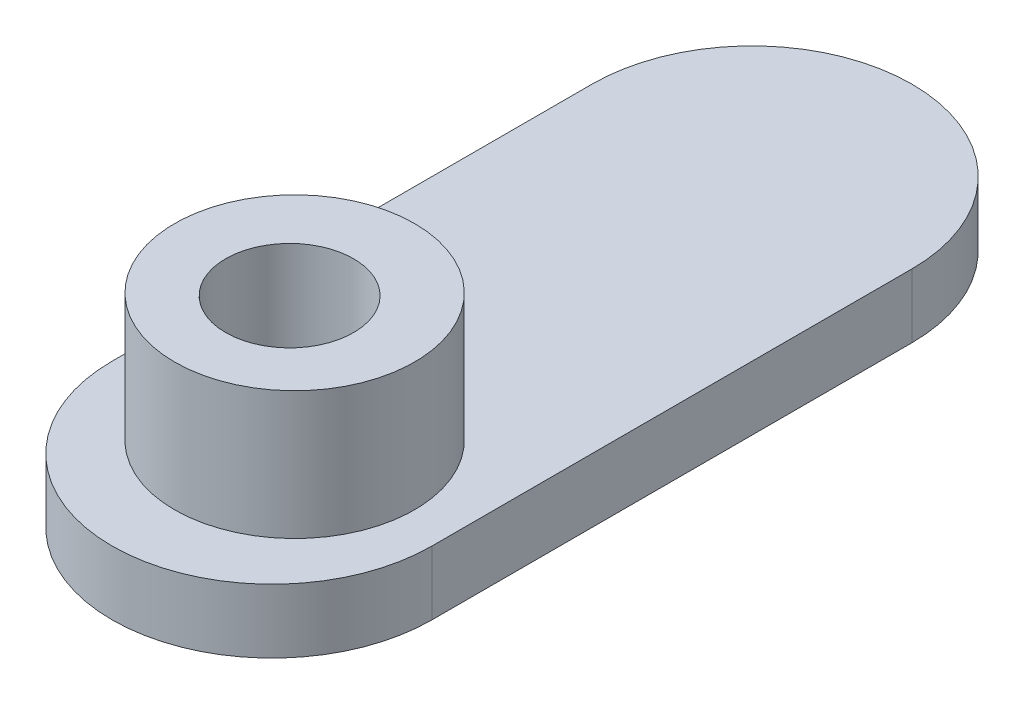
from build123d import *

# Parameters (mm, degrees)
BASE_DEPTH     = 20
SKETCH2_R      = 37.5
BOSS_DEPTH     = 40
SKETCH3_R      = 20
BOSSHOLE_DEPTH = 215.709105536


with BuildPart() as part:
    # Sketch1 → Base (new body)
    with BuildSketch(Plane(origin=(0, 0, 0), x_dir=(1, 0, 0), z_dir=(0, 1, 0))):
        with BuildLine():
            Line((50, 0), (50, 150))
            ThreePointArc((50, 150), (0, 200), (-50, 150))
            Line((-50, 150), (-50, 0))
            ThreePointArc((-50, 0), (0, -50), (50, 0))
        make_face()
    extrude(amount=BASE_DEPTH)

    # Sketch2 → Boss (add)
    with BuildSketch(Plane(origin=(0, 20, 0), x_dir=(1, 0, 0), z_dir=(0, 1, 0))):
        with Locations(Location((0, 7.055875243, 0), (0, 0, 270))):
            Circle(SKETCH2_R)
    extrude(amount=BOSS_DEPTH)

    # Sketch3 → BossHole (cut, through all)
    with BuildSketch(Plane(origin=(0, 60, 0), x_dir=(1, 0, 0), z_dir=(0, 1, 0))):
        with Locations(Location((0, 5.5, 0), (0, 0, 270))):
            Circle(SKETCH3_R)
    extrude(amount=-BOSSHOLE_DEPTH, mode=Mode.SUBTRACT)


solid = part.part
